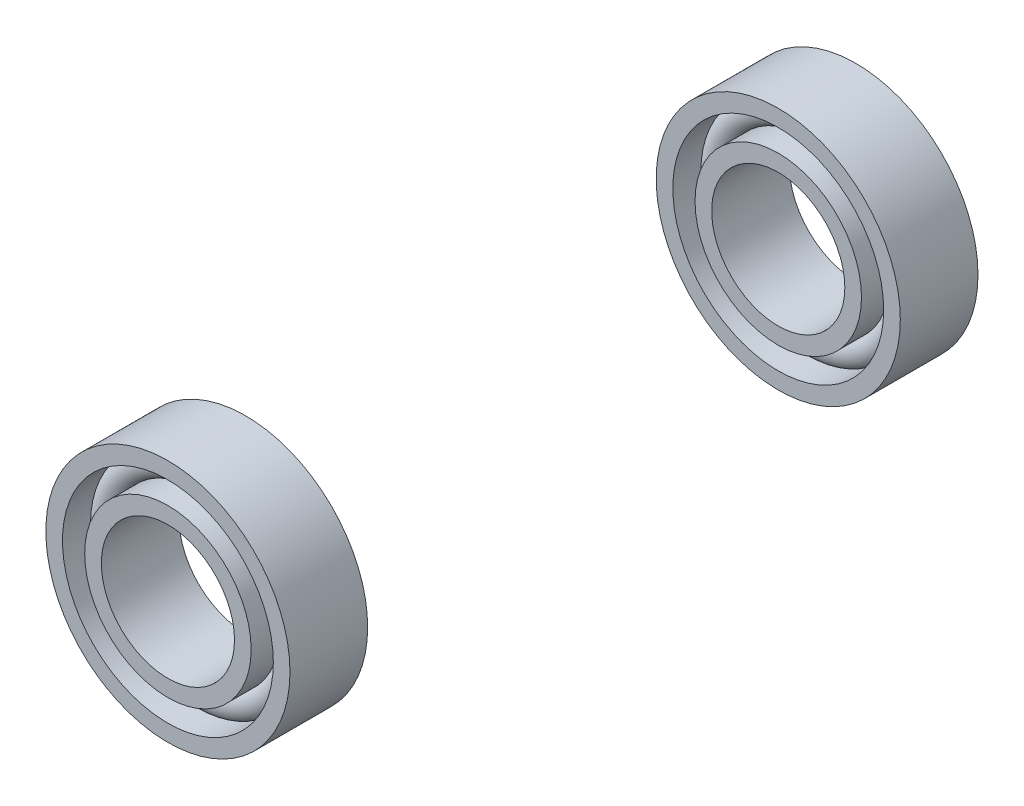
from build123d import *

# Parameters (mm, degrees)
SK_PISTA_INT_1_W = 1.5
SK_PISTA_INT_1_H = 7
SK_PISTA_EXT_1_W = 1.5
SK_PISTA_EXT_1_H = 7
SK_BOLAS_1_R     = 1.4
SK_PISTA_INT_2_W = 1.5
SK_PISTA_INT_2_H = 7
SK_PISTA_EXT_2_W = 1.5
SK_PISTA_EXT_2_H = 7
SK_BOLAS_2_R     = 1.4


with BuildPart() as part:
    # Sk_Pista_int_1 → Pista_int_1 (revolve)
    with BuildSketch(Plane(origin=(0, 0, 0), x_dir=(1, 0, 0), z_dir=(0, 1, 0)), mode=Mode.PRIVATE) as pista_int_1_sk:
        with Locations((-179.25, 88)):
            Rectangle(SK_PISTA_INT_1_W, SK_PISTA_INT_1_H)
    revolve(pista_int_1_sk.sketch.rotate(Axis((-172.5, 0, -79.5), (0, 0, -1)), 180), axis=Axis((-172.5, 0, -79.5), (0, 0, -1)))



with BuildPart() as body_2:
    # Sk_Pista_ext_1 → Pista_ext_1 (revolve)
    with BuildSketch(Plane(origin=(0, 0, 0), x_dir=(1, 0, 0), z_dir=(0, 1, 0)), mode=Mode.PRIVATE) as pista_ext_1_sk:
        with Locations((-182.75, 88)):
            Rectangle(SK_PISTA_EXT_1_W, SK_PISTA_EXT_1_H)
    revolve(pista_ext_1_sk.sketch.rotate(Axis((-172.5, 0, -79.5), (0, 0, -1)), 180), axis=Axis((-172.5, 0, -79.5), (0, 0, -1)))


with BuildPart() as part_1:
    add(part.part)

    add(body_2.part)  # Bolas_1 merges body 2
    # Sk_Bolas_1 → Bolas_1 (revolve)
    with BuildSketch(Plane(origin=(0, 0, 0), x_dir=(1, 0, 0), z_dir=(0, 1, 0)), mode=Mode.PRIVATE) as bolas_1_sk:
        with Locations((-181, 88)):
            Circle(SK_BOLAS_1_R)
    revolve(bolas_1_sk.sketch.rotate(Axis((-172.5, 0, -83), (0, 0, -1)), 180), axis=Axis((-172.5, 0, -83), (0, 0, -1)))


with BuildPart() as body_2_2:
    # Sk_Pista_int_2 → Pista_int_2 (revolve)
    with BuildSketch(Plane(origin=(0, 0, 0), x_dir=(1, 0, 0), z_dir=(0, 1, 0)), mode=Mode.PRIVATE) as pista_int_2_sk:
        with Locations((-179.25, 143)):
            Rectangle(SK_PISTA_INT_2_W, SK_PISTA_INT_2_H)
    revolve(pista_int_2_sk.sketch.rotate(Axis((-172.5, 0, -134.5), (0, 0, -1)), 180), axis=Axis((-172.5, 0, -134.5), (0, 0, -1)))



with BuildPart() as body_3:
    # Sk_Pista_ext_2 → Pista_ext_2 (revolve)
    with BuildSketch(Plane(origin=(0, 0, 0), x_dir=(1, 0, 0), z_dir=(0, 1, 0)), mode=Mode.PRIVATE) as pista_ext_2_sk:
        with Locations((-182.75, 143)):
            Rectangle(SK_PISTA_EXT_2_W, SK_PISTA_EXT_2_H)
    revolve(pista_ext_2_sk.sketch.rotate(Axis((-172.5, 0, -134.5), (0, 0, -1)), 180), axis=Axis((-172.5, 0, -134.5), (0, 0, -1)))


with BuildPart() as body_2_2_1:
    add(body_2_2.part)

    add(body_3.part)  # Bolas_2 merges body 3
    # Sk_Bolas_2 → Bolas_2 (revolve)
    with BuildSketch(Plane(origin=(0, 0, 0), x_dir=(1, 0, 0), z_dir=(0, 1, 0)), mode=Mode.PRIVATE) as bolas_2_sk:
        with Locations((-181, 143)):
            Circle(SK_BOLAS_2_R)
    revolve(bolas_2_sk.sketch.rotate(Axis((-172.5, 0, -138), (0, 0, -1)), 180), axis=Axis((-172.5, 0, -138), (0, 0, -1)))


solid = Compound([part_1.part, body_2_2_1.part])
